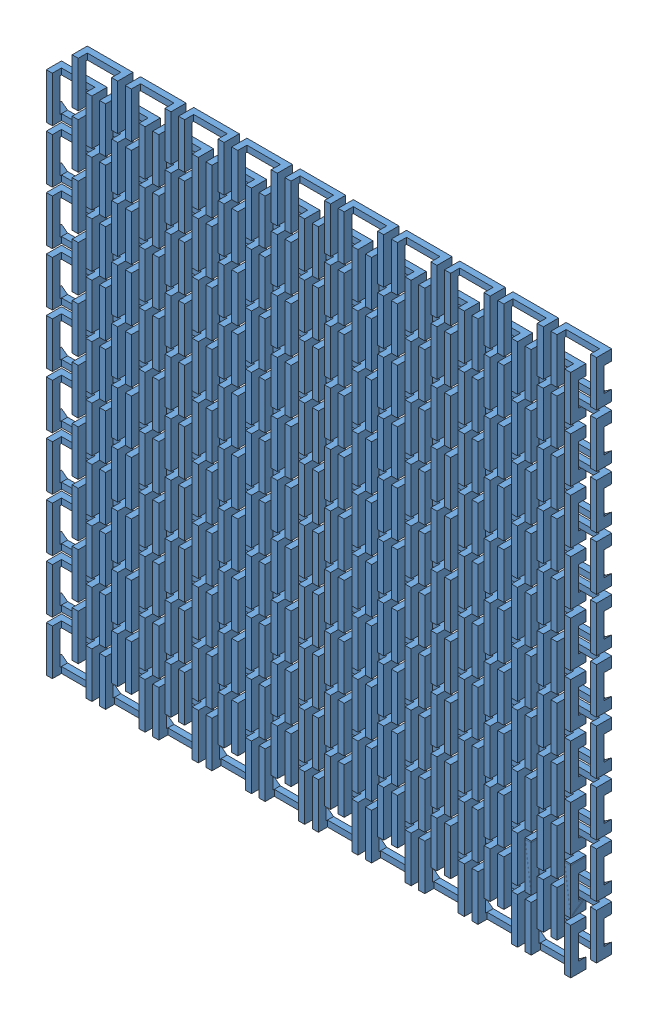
SolidWorks assembly Fabric2.SLDASM, configuration Default (file format 10000). Lengths in mm.
Overall size (72.4 72.4 2).
203 component instances, 1 part files, 12 mates.
Components (placement in the parent):
- fabric1-1: fabric1.SLDPRT [Default] at (0.3008 0.4192 2.1343) size (6 6 2)
- fabric1-2: fabric1.SLDPRT [Default] at (-3.0992 3.8192 2.1343) size (6 6 2)
- fabric1-3: fabric1.SLDPRT [Default] at (3.7008 -2.9808 2.1343) size (6 6 2) (hidden)
- fabric1-4: fabric1.SLDPRT [Default] at (-3.0992 -2.9808 2.1343) size (6 6 2)
- fabric1-5: fabric1.SLDPRT [Default] at (3.7008 3.8192 2.1343) size (6 6 2) (hidden)
- fabric1-6: fabric1.SLDPRT [Default] at (0.3008 7.4192 2.1343) size (6 6 2)
- fabric1-7: fabric1.SLDPRT [Default] at (-6.6992 0.4192 2.1343) size (6 6 2)
- fabric1-8: fabric1.SLDPRT [Default] at (-6.6992 7.4192 2.1343) size (6 6 2)
- fabric1-29: fabric1.SLDPRT [Default] at (0.3008 14.4192 2.1343) size (6 6 2)
- fabric1-30: fabric1.SLDPRT [Default] at (-6.6992 14.4192 2.1343) size (6 6 2)
- fabric1-31: fabric1.SLDPRT [Default] at (-13.6992 0.4192 2.1343) size (6 6 2)
- fabric1-32: fabric1.SLDPRT [Default] at (-13.6992 7.4192 2.1343) size (6 6 2)
- fabric1-33: fabric1.SLDPRT [Default] at (-13.6992 14.4192 2.1343) size (6 6 2)
- fabric1-144: fabric1.SLDPRT [Default] at (0.3008 21.4192 2.1343) size (6 6 2)
- fabric1-145: fabric1.SLDPRT [Default] at (0.3008 28.4192 2.1343) size (6 6 2)
- fabric1-146: fabric1.SLDPRT [Default] at (0.3008 35.4192 2.1343) size (6 6 2)
- fabric1-147: fabric1.SLDPRT [Default] at (0.3008 42.4192 2.1343) size (6 6 2)
- fabric1-148: fabric1.SLDPRT [Default] at (0.3008 49.4192 2.1343) size (6 6 2)
- fabric1-149: fabric1.SLDPRT [Default] at (0.3008 56.4192 2.1343) size (6 6 2)
- fabric1-150: fabric1.SLDPRT [Default] at (0.3008 63.4192 2.1343) size (6 6 2)
- fabric1-151: fabric1.SLDPRT [Default] at (-6.6992 21.4192 2.1343) size (6 6 2)
- fabric1-152: fabric1.SLDPRT [Default] at (-6.6992 28.4192 2.1343) size (6 6 2)
- fabric1-153: fabric1.SLDPRT [Default] at (-6.6992 35.4192 2.1343) size (6 6 2)
- fabric1-154: fabric1.SLDPRT [Default] at (-6.6992 42.4192 2.1343) size (6 6 2)
- fabric1-155: fabric1.SLDPRT [Default] at (-6.6992 49.4192 2.1343) size (6 6 2)
- fabric1-156: fabric1.SLDPRT [Default] at (-6.6992 56.4192 2.1343) size (6 6 2)
- fabric1-157: fabric1.SLDPRT [Default] at (-6.6992 63.4192 2.1343) size (6 6 2)
- fabric1-158: fabric1.SLDPRT [Default] at (-13.6992 21.4192 2.1343) size (6 6 2)
- fabric1-159: fabric1.SLDPRT [Default] at (-13.6992 28.4192 2.1343) size (6 6 2)
- fabric1-160: fabric1.SLDPRT [Default] at (-13.6992 35.4192 2.1343) size (6 6 2)
- fabric1-161: fabric1.SLDPRT [Default] at (-13.6992 42.4192 2.1343) size (6 6 2)
- fabric1-162: fabric1.SLDPRT [Default] at (-13.6992 49.4192 2.1343) size (6 6 2)
- fabric1-163: fabric1.SLDPRT [Default] at (-13.6992 56.4192 2.1343) size (6 6 2)
- fabric1-164: fabric1.SLDPRT [Default] at (-13.6992 63.4192 2.1343) size (6 6 2)
- fabric1-165: fabric1.SLDPRT [Default] at (-20.6992 0.4192 2.1343) size (6 6 2)
- fabric1-166: fabric1.SLDPRT [Default] at (-20.6992 7.4192 2.1343) size (6 6 2)
- fabric1-167: fabric1.SLDPRT [Default] at (-20.6992 14.4192 2.1343) size (6 6 2)
- fabric1-168: fabric1.SLDPRT [Default] at (-20.6992 21.4192 2.1343) size (6 6 2)
- fabric1-169: fabric1.SLDPRT [Default] at (-20.6992 28.4192 2.1343) size (6 6 2)
- fabric1-170: fabric1.SLDPRT [Default] at (-20.6992 35.4192 2.1343) size (6 6 2)
- fabric1-171: fabric1.SLDPRT [Default] at (-20.6992 42.4192 2.1343) size (6 6 2)
- fabric1-172: fabric1.SLDPRT [Default] at (-20.6992 49.4192 2.1343) size (6 6 2)
- fabric1-173: fabric1.SLDPRT [Default] at (-20.6992 56.4192 2.1343) size (6 6 2)
- fabric1-174: fabric1.SLDPRT [Default] at (-20.6992 63.4192 2.1343) size (6 6 2)
- fabric1-175: fabric1.SLDPRT [Default] at (-27.6992 0.4192 2.1343) size (6 6 2)
- fabric1-176: fabric1.SLDPRT [Default] at (-27.6992 7.4192 2.1343) size (6 6 2)
- fabric1-177: fabric1.SLDPRT [Default] at (-27.6992 14.4192 2.1343) size (6 6 2)
- fabric1-178: fabric1.SLDPRT [Default] at (-27.6992 21.4192 2.1343) size (6 6 2)
- fabric1-179: fabric1.SLDPRT [Default] at (-27.6992 28.4192 2.1343) size (6 6 2)
- fabric1-180: fabric1.SLDPRT [Default] at (-27.6992 35.4192 2.1343) size (6 6 2)
- fabric1-181: fabric1.SLDPRT [Default] at (-27.6992 42.4192 2.1343) size (6 6 2)
- fabric1-182: fabric1.SLDPRT [Default] at (-27.6992 49.4192 2.1343) size (6 6 2)
- fabric1-183: fabric1.SLDPRT [Default] at (-27.6992 56.4192 2.1343) size (6 6 2)
- fabric1-184: fabric1.SLDPRT [Default] at (-27.6992 63.4192 2.1343) size (6 6 2)
- fabric1-185: fabric1.SLDPRT [Default] at (-34.6992 0.4192 2.1343) size (6 6 2)
- fabric1-186: fabric1.SLDPRT [Default] at (-34.6992 7.4192 2.1343) size (6 6 2)
- fabric1-187: fabric1.SLDPRT [Default] at (-34.6992 14.4192 2.1343) size (6 6 2)
- fabric1-188: fabric1.SLDPRT [Default] at (-34.6992 21.4192 2.1343) size (6 6 2)
- fabric1-189: fabric1.SLDPRT [Default] at (-34.6992 28.4192 2.1343) size (6 6 2)
- fabric1-190: fabric1.SLDPRT [Default] at (-34.6992 35.4192 2.1343) size (6 6 2)
- fabric1-191: fabric1.SLDPRT [Default] at (-34.6992 42.4192 2.1343) size (6 6 2)
- fabric1-192: fabric1.SLDPRT [Default] at (-34.6992 49.4192 2.1343) size (6 6 2)
- fabric1-193: fabric1.SLDPRT [Default] at (-34.6992 56.4192 2.1343) size (6 6 2)
- fabric1-194: fabric1.SLDPRT [Default] at (-34.6992 63.4192 2.1343) size (6 6 2)
- fabric1-195: fabric1.SLDPRT [Default] at (-41.6992 0.4192 2.1343) size (6 6 2)
- fabric1-196: fabric1.SLDPRT [Default] at (-41.6992 7.4192 2.1343) size (6 6 2)
- fabric1-197: fabric1.SLDPRT [Default] at (-41.6992 14.4192 2.1343) size (6 6 2)
- fabric1-198: fabric1.SLDPRT [Default] at (-41.6992 21.4192 2.1343) size (6 6 2)
- fabric1-199: fabric1.SLDPRT [Default] at (-41.6992 28.4192 2.1343) size (6 6 2)
- fabric1-200: fabric1.SLDPRT [Default] at (-41.6992 35.4192 2.1343) size (6 6 2)
- fabric1-201: fabric1.SLDPRT [Default] at (-41.6992 42.4192 2.1343) size (6 6 2)
- fabric1-202: fabric1.SLDPRT [Default] at (-41.6992 49.4192 2.1343) size (6 6 2)
- fabric1-203: fabric1.SLDPRT [Default] at (-41.6992 56.4192 2.1343) size (6 6 2)
- fabric1-204: fabric1.SLDPRT [Default] at (-41.6992 63.4192 2.1343) size (6 6 2)
- fabric1-205: fabric1.SLDPRT [Default] at (-48.6992 0.4192 2.1343) size (6 6 2)
- fabric1-206: fabric1.SLDPRT [Default] at (-48.6992 7.4192 2.1343) size (6 6 2)
- fabric1-207: fabric1.SLDPRT [Default] at (-48.6992 14.4192 2.1343) size (6 6 2)
- fabric1-208: fabric1.SLDPRT [Default] at (-48.6992 21.4192 2.1343) size (6 6 2)
- fabric1-209: fabric1.SLDPRT [Default] at (-48.6992 28.4192 2.1343) size (6 6 2)
- fabric1-210: fabric1.SLDPRT [Default] at (-48.6992 35.4192 2.1343) size (6 6 2)
- fabric1-211: fabric1.SLDPRT [Default] at (-48.6992 42.4192 2.1343) size (6 6 2)
- fabric1-212: fabric1.SLDPRT [Default] at (-48.6992 49.4192 2.1343) size (6 6 2)
- fabric1-213: fabric1.SLDPRT [Default] at (-48.6992 56.4192 2.1343) size (6 6 2)
- fabric1-214: fabric1.SLDPRT [Default] at (-48.6992 63.4192 2.1343) size (6 6 2)
- fabric1-215: fabric1.SLDPRT [Default] at (-55.6992 0.4192 2.1343) size (6 6 2)
- fabric1-216: fabric1.SLDPRT [Default] at (-55.6992 7.4192 2.1343) size (6 6 2)
- fabric1-217: fabric1.SLDPRT [Default] at (-55.6992 14.4192 2.1343) size (6 6 2)
- fabric1-218: fabric1.SLDPRT [Default] at (-55.6992 21.4192 2.1343) size (6 6 2)
- fabric1-219: fabric1.SLDPRT [Default] at (-55.6992 28.4192 2.1343) size (6 6 2)
- fabric1-220: fabric1.SLDPRT [Default] at (-55.6992 35.4192 2.1343) size (6 6 2)
- fabric1-221: fabric1.SLDPRT [Default] at (-55.6992 42.4192 2.1343) size (6 6 2)
- fabric1-222: fabric1.SLDPRT [Default] at (-55.6992 49.4192 2.1343) size (6 6 2)
- fabric1-223: fabric1.SLDPRT [Default] at (-55.6992 56.4192 2.1343) size (6 6 2)
- fabric1-224: fabric1.SLDPRT [Default] at (-55.6992 63.4192 2.1343) size (6 6 2)
- fabric1-225: fabric1.SLDPRT [Default] at (-62.6992 0.4192 2.1343) size (6 6 2)
- fabric1-226: fabric1.SLDPRT [Default] at (-62.6992 7.4192 2.1343) size (6 6 2)
- fabric1-227: fabric1.SLDPRT [Default] at (-62.6992 14.4192 2.1343) size (6 6 2)
- fabric1-228: fabric1.SLDPRT [Default] at (-62.6992 21.4192 2.1343) size (6 6 2)
- fabric1-229: fabric1.SLDPRT [Default] at (-62.6992 28.4192 2.1343) size (6 6 2)
- fabric1-230: fabric1.SLDPRT [Default] at (-62.6992 35.4192 2.1343) size (6 6 2)
- fabric1-231: fabric1.SLDPRT [Default] at (-62.6992 42.4192 2.1343) size (6 6 2)
- fabric1-232: fabric1.SLDPRT [Default] at (-62.6992 49.4192 2.1343) size (6 6 2)
- fabric1-233: fabric1.SLDPRT [Default] at (-62.6992 56.4192 2.1343) size (6 6 2)
- fabric1-234: fabric1.SLDPRT [Default] at (-62.6992 63.4192 2.1343) size (6 6 2)
- fabric1-963: fabric1.SLDPRT [Default] at (-10.0992 -2.9808 2.1343) size (6 6 2)
- fabric1-964: fabric1.SLDPRT [Default] at (-17.0992 -2.9808 2.1343) size (6 6 2)
- fabric1-965: fabric1.SLDPRT [Default] at (-24.0992 -2.9808 2.1343) size (6 6 2)
- fabric1-966: fabric1.SLDPRT [Default] at (-31.0992 -2.9808 2.1343) size (6 6 2)
- fabric1-967: fabric1.SLDPRT [Default] at (-38.0992 -2.9808 2.1343) size (6 6 2)
- fabric1-968: fabric1.SLDPRT [Default] at (-45.0992 -2.9808 2.1343) size (6 6 2)
- fabric1-969: fabric1.SLDPRT [Default] at (-52.0992 -2.9808 2.1343) size (6 6 2)
- fabric1-970: fabric1.SLDPRT [Default] at (-59.0992 -2.9808 2.1343) size (6 6 2)
- fabric1-971: fabric1.SLDPRT [Default] at (-66.0992 -2.9808 2.1343) size (6 6 2)
- fabric1-982: fabric1.SLDPRT [Default] at (-3.0992 4.0192 2.1343) size (6 6 2)
- fabric1-983: fabric1.SLDPRT [Default] at (-10.0992 4.0192 2.1343) size (6 6 2)
- fabric1-984: fabric1.SLDPRT [Default] at (-17.0992 4.0192 2.1343) size (6 6 2)
- fabric1-985: fabric1.SLDPRT [Default] at (-24.0992 4.0192 2.1343) size (6 6 2)
- fabric1-986: fabric1.SLDPRT [Default] at (-31.0992 4.0192 2.1343) size (6 6 2)
- fabric1-987: fabric1.SLDPRT [Default] at (-38.0992 4.0192 2.1343) size (6 6 2)
- fabric1-988: fabric1.SLDPRT [Default] at (-45.0992 4.0192 2.1343) size (6 6 2)
- fabric1-989: fabric1.SLDPRT [Default] at (-52.0992 4.0192 2.1343) size (6 6 2)
- fabric1-990: fabric1.SLDPRT [Default] at (-59.0992 4.0192 2.1343) size (6 6 2)
- fabric1-991: fabric1.SLDPRT [Default] at (-66.0992 4.0192 2.1343) size (6 6 2)
- fabric1-1002: fabric1.SLDPRT [Default] at (-3.0992 11.0192 2.1343) size (6 6 2)
- fabric1-1003: fabric1.SLDPRT [Default] at (-10.0992 11.0192 2.1343) size (6 6 2)
- fabric1-1004: fabric1.SLDPRT [Default] at (-17.0992 11.0192 2.1343) size (6 6 2)
- fabric1-1005: fabric1.SLDPRT [Default] at (-24.0992 11.0192 2.1343) size (6 6 2)
- fabric1-1006: fabric1.SLDPRT [Default] at (-31.0992 11.0192 2.1343) size (6 6 2)
- fabric1-1007: fabric1.SLDPRT [Default] at (-38.0992 11.0192 2.1343) size (6 6 2)
- fabric1-1008: fabric1.SLDPRT [Default] at (-45.0992 11.0192 2.1343) size (6 6 2)
- fabric1-1009: fabric1.SLDPRT [Default] at (-52.0992 11.0192 2.1343) size (6 6 2)
- fabric1-1010: fabric1.SLDPRT [Default] at (-59.0992 11.0192 2.1343) size (6 6 2)
- fabric1-1011: fabric1.SLDPRT [Default] at (-66.0992 11.0192 2.1343) size (6 6 2)
- fabric1-1022: fabric1.SLDPRT [Default] at (-3.0992 18.0192 2.1343) size (6 6 2)
- fabric1-1023: fabric1.SLDPRT [Default] at (-10.0992 18.0192 2.1343) size (6 6 2)
- fabric1-1024: fabric1.SLDPRT [Default] at (-17.0992 18.0192 2.1343) size (6 6 2)
- fabric1-1025: fabric1.SLDPRT [Default] at (-24.0992 18.0192 2.1343) size (6 6 2)
- fabric1-1026: fabric1.SLDPRT [Default] at (-31.0992 18.0192 2.1343) size (6 6 2)
- fabric1-1027: fabric1.SLDPRT [Default] at (-38.0992 18.0192 2.1343) size (6 6 2)
- fabric1-1028: fabric1.SLDPRT [Default] at (-45.0992 18.0192 2.1343) size (6 6 2)
- fabric1-1029: fabric1.SLDPRT [Default] at (-52.0992 18.0192 2.1343) size (6 6 2)
- fabric1-1030: fabric1.SLDPRT [Default] at (-59.0992 18.0192 2.1343) size (6 6 2)
- fabric1-1031: fabric1.SLDPRT [Default] at (-66.0992 18.0192 2.1343) size (6 6 2)
- fabric1-1042: fabric1.SLDPRT [Default] at (-3.0992 25.0192 2.1343) size (6 6 2)
- fabric1-1043: fabric1.SLDPRT [Default] at (-10.0992 25.0192 2.1343) size (6 6 2)
- fabric1-1044: fabric1.SLDPRT [Default] at (-17.0992 25.0192 2.1343) size (6 6 2)
- fabric1-1045: fabric1.SLDPRT [Default] at (-24.0992 25.0192 2.1343) size (6 6 2)
- fabric1-1046: fabric1.SLDPRT [Default] at (-31.0992 25.0192 2.1343) size (6 6 2)
- fabric1-1047: fabric1.SLDPRT [Default] at (-38.0992 25.0192 2.1343) size (6 6 2)
- fabric1-1048: fabric1.SLDPRT [Default] at (-45.0992 25.0192 2.1343) size (6 6 2)
- fabric1-1049: fabric1.SLDPRT [Default] at (-52.0992 25.0192 2.1343) size (6 6 2)
- fabric1-1050: fabric1.SLDPRT [Default] at (-59.0992 25.0192 2.1343) size (6 6 2)
- fabric1-1051: fabric1.SLDPRT [Default] at (-66.0992 25.0192 2.1343) size (6 6 2)
- fabric1-1062: fabric1.SLDPRT [Default] at (-3.0992 32.0192 2.1343) size (6 6 2)
- fabric1-1063: fabric1.SLDPRT [Default] at (-10.0992 32.0192 2.1343) size (6 6 2)
- fabric1-1064: fabric1.SLDPRT [Default] at (-17.0992 32.0192 2.1343) size (6 6 2)
- fabric1-1065: fabric1.SLDPRT [Default] at (-24.0992 32.0192 2.1343) size (6 6 2)
- fabric1-1066: fabric1.SLDPRT [Default] at (-31.0992 32.0192 2.1343) size (6 6 2)
- fabric1-1067: fabric1.SLDPRT [Default] at (-38.0992 32.0192 2.1343) size (6 6 2)
- fabric1-1068: fabric1.SLDPRT [Default] at (-45.0992 32.0192 2.1343) size (6 6 2)
- fabric1-1069: fabric1.SLDPRT [Default] at (-52.0992 32.0192 2.1343) size (6 6 2)
- fabric1-1070: fabric1.SLDPRT [Default] at (-59.0992 32.0192 2.1343) size (6 6 2)
- fabric1-1071: fabric1.SLDPRT [Default] at (-66.0992 32.0192 2.1343) size (6 6 2)
- fabric1-1082: fabric1.SLDPRT [Default] at (-3.0992 39.0192 2.1343) size (6 6 2)
- fabric1-1083: fabric1.SLDPRT [Default] at (-10.0992 39.0192 2.1343) size (6 6 2)
- fabric1-1084: fabric1.SLDPRT [Default] at (-17.0992 39.0192 2.1343) size (6 6 2)
- fabric1-1085: fabric1.SLDPRT [Default] at (-24.0992 39.0192 2.1343) size (6 6 2)
- fabric1-1086: fabric1.SLDPRT [Default] at (-31.0992 39.0192 2.1343) size (6 6 2)
- fabric1-1087: fabric1.SLDPRT [Default] at (-38.0992 39.0192 2.1343) size (6 6 2)
- fabric1-1088: fabric1.SLDPRT [Default] at (-45.0992 39.0192 2.1343) size (6 6 2)
- fabric1-1089: fabric1.SLDPRT [Default] at (-52.0992 39.0192 2.1343) size (6 6 2)
- fabric1-1090: fabric1.SLDPRT [Default] at (-59.0992 39.0192 2.1343) size (6 6 2)
- fabric1-1091: fabric1.SLDPRT [Default] at (-66.0992 39.0192 2.1343) size (6 6 2)
- fabric1-1102: fabric1.SLDPRT [Default] at (-3.0992 46.0192 2.1343) size (6 6 2)
- fabric1-1103: fabric1.SLDPRT [Default] at (-10.0992 46.0192 2.1343) size (6 6 2)
- fabric1-1104: fabric1.SLDPRT [Default] at (-17.0992 46.0192 2.1343) size (6 6 2)
- fabric1-1105: fabric1.SLDPRT [Default] at (-24.0992 46.0192 2.1343) size (6 6 2)
- fabric1-1106: fabric1.SLDPRT [Default] at (-31.0992 46.0192 2.1343) size (6 6 2)
- fabric1-1107: fabric1.SLDPRT [Default] at (-38.0992 46.0192 2.1343) size (6 6 2)
- fabric1-1108: fabric1.SLDPRT [Default] at (-45.0992 46.0192 2.1343) size (6 6 2)
- fabric1-1109: fabric1.SLDPRT [Default] at (-52.0992 46.0192 2.1343) size (6 6 2)
- fabric1-1110: fabric1.SLDPRT [Default] at (-59.0992 46.0192 2.1343) size (6 6 2)
- fabric1-1111: fabric1.SLDPRT [Default] at (-66.0992 46.0192 2.1343) size (6 6 2)
- fabric1-1122: fabric1.SLDPRT [Default] at (-3.0992 53.0192 2.1343) size (6 6 2)
- fabric1-1123: fabric1.SLDPRT [Default] at (-10.0992 53.0192 2.1343) size (6 6 2)
- fabric1-1124: fabric1.SLDPRT [Default] at (-17.0992 53.0192 2.1343) size (6 6 2)
- fabric1-1125: fabric1.SLDPRT [Default] at (-24.0992 53.0192 2.1343) size (6 6 2)
- fabric1-1126: fabric1.SLDPRT [Default] at (-31.0992 53.0192 2.1343) size (6 6 2)
- fabric1-1127: fabric1.SLDPRT [Default] at (-38.0992 53.0192 2.1343) size (6 6 2)
- fabric1-1128: fabric1.SLDPRT [Default] at (-45.0992 53.0192 2.1343) size (6 6 2)
- fabric1-1129: fabric1.SLDPRT [Default] at (-52.0992 53.0192 2.1343) size (6 6 2)
- fabric1-1130: fabric1.SLDPRT [Default] at (-59.0992 53.0192 2.1343) size (6 6 2)
- fabric1-1131: fabric1.SLDPRT [Default] at (-66.0992 53.0192 2.1343) size (6 6 2)
- fabric1-1142: fabric1.SLDPRT [Default] at (-3.0992 60.0192 2.1343) size (6 6 2)
- fabric1-1143: fabric1.SLDPRT [Default] at (-10.0992 60.0192 2.1343) size (6 6 2)
- fabric1-1144: fabric1.SLDPRT [Default] at (-17.0992 60.0192 2.1343) size (6 6 2)
- fabric1-1145: fabric1.SLDPRT [Default] at (-24.0992 60.0192 2.1343) size (6 6 2)
- fabric1-1146: fabric1.SLDPRT [Default] at (-31.0992 60.0192 2.1343) size (6 6 2)
- fabric1-1147: fabric1.SLDPRT [Default] at (-38.0992 60.0192 2.1343) size (6 6 2)
- fabric1-1148: fabric1.SLDPRT [Default] at (-45.0992 60.0192 2.1343) size (6 6 2)
- fabric1-1149: fabric1.SLDPRT [Default] at (-52.0992 60.0192 2.1343) size (6 6 2)
- fabric1-1150: fabric1.SLDPRT [Default] at (-59.0992 60.0192 2.1343) size (6 6 2)
- fabric1-1151: fabric1.SLDPRT [Default] at (-66.0992 60.0192 2.1343) size (6 6 2)
Mates (geometry in assembly coordinates):
- Coincident3: coincident aligned: plane of fabric1-2 through (-3.0992 3.8192 4.1343) normal (0 0 1); plane of fabric1-3 through (3.7008 -2.9808 4.1343) normal (0 0 1)
- Coincident4: coincident aligned: plane of fabric1-4 through (-3.0992 -2.9808 4.1343) normal (0 0 1); plane of fabric1-5 through (3.7008 3.8192 4.1343) normal (0 0 1)
- Coincident5: coincident aligned: plane of fabric1-3 through (3.7008 -2.9808 4.1343) normal (0 0 1); plane of fabric1-4 through (-3.0992 -2.9808 4.1343) normal (0 0 1)
- Coincident7: coincident aligned: plane of fabric1-2 through (-3.0992 3.8192 4.1343) normal (-1 0 0); plane of fabric1-4 through (-3.0992 -2.9808 4.1343) normal (-1 0 0)
- Coincident8: coincident aligned: plane of fabric1-2 through (-3.0992 9.8192 4.1343) normal (0 1 0); plane of fabric1-5 through (3.7008 9.8192 4.1343) normal (0 1 0)
- Coincident9: coincident aligned: plane of fabric1-3 through (9.7008 -2.9808 4.1343) normal (1 0 0); plane of fabric1-5 through (9.7008 3.8192 4.1343) normal (1 0 0)
- Coincident10: coincident aligned: plane of fabric1-3 through (3.7008 -2.9808 4.1343) normal (0 -1 0); plane of fabric1-4 through (-3.0992 -2.9808 4.1343) normal (0 -1 0)
- Coincident12: coincident aligned: plane of fabric1-1 through (0.3008 0.4192 2.1343) normal (0 0 -1); plane of fabric1-4 through (-3.0992 -2.9808 2.1343) normal (0 0 -1)
- Distance2: distance = 0.8 mm anti-aligned: plane of fabric1-5 through (3.7008 3.8192 4.1343) normal (-1 0 0); plane of fabric1-2 through (2.9008 3.8192 4.1343) normal (1 0 0)
- Distance3: distance = 0.8 mm anti-aligned: plane of fabric1-2 through (-3.0992 3.8192 4.1343) normal (0 -1 0); plane of fabric1-4 through (-3.0992 3.0192 4.1343) normal (0 1 0)
- Width1: width anti-aligned: plane of ? through (12.5008 1.2192 4.1343) normal (-1 0 0); plane of fabric1-7 through (-5.8992 1.2192 4.1343) normal (1 0 0); plane of fabric1-5 through (9.7008 3.8192 4.1343) normal (1 0 0); plane of fabric1-2 through (-3.0992 3.8192 4.1343) normal (-1 0 0)
- Width2: width aligned: plane of ? through (5.5008 -5.7808 3.1343) normal (0 1 0); plane of fabric1-6 through (5.5008 12.6192 3.1343) normal (0 -1 0); plane of fabric1-5 through (3.7008 9.8192 4.1343) normal (0 1 0); plane of fabric1-3 through (3.7008 -2.9808 4.1343) normal (0 -1 0)
